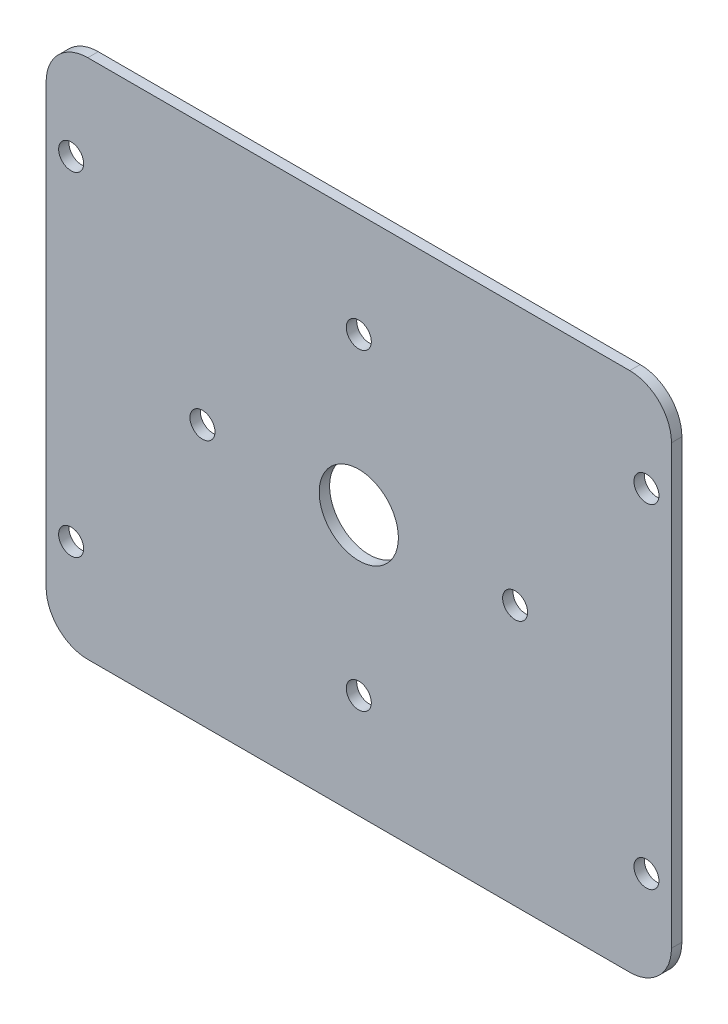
from build123d import *

# Parameters (mm, degrees)
ESQUISSE1_W             = 300
ESQUISSE1_H             = 250
EXTRUSION1_DEPTH        = 5
ESQUISSE2_R             = 19
ENL_V_MAT_EXTRU_1_DEPTH = 391.544491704
CONG_1_R                = 20
ESQUISSE3_R             = 6
ENL_V_MAT_EXTRU_2_DEPTH = 391.544491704
ESQUISSE4_R             = 6
ENL_V_MAT_EXTRU_3_DEPTH = 391.544491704


with BuildPart() as part:
    # Esquisse1 → Extrusion1 (new body)
    with BuildSketch(Plane.XY):
        with Locations((150, 125)):
            Rectangle(ESQUISSE1_W, ESQUISSE1_H)
    extrude(amount=EXTRUSION1_DEPTH)

    # Esquisse2 → Enl_v. mat.-Extru.1 (cut, through all)
    with BuildSketch(Plane.XY.offset(5)):
        with Locations((150, 125)):
            Circle(ESQUISSE2_R)
    extrude(amount=-ENL_V_MAT_EXTRU_1_DEPTH, mode=Mode.SUBTRACT)

    # Cong_1
    cong_1_edges = [part.edges().sort_by_distance(p)[0] for p in [
        (0, 250, 2.5),
        (300, 250, 2.5),
        (300, 0, 2.5),
        (0, 0, 2.5),
    ]]
    fillet(cong_1_edges, radius=CONG_1_R)

    # Esquisse3 → Enl_v. mat.-Extru.2 (cut, through all)
    with BuildSketch(Plane.XY.offset(5)):
        with Locations((12, 205)):
            Circle(ESQUISSE3_R)
        with Locations(Location((12, 45, 0), (0, 0, 180))):
            Circle(ESQUISSE3_R)
        with Locations((288, 45)):
            Circle(ESQUISSE3_R)
        with Locations(Location((288, 205, 0), (0, 0, 180))):
            Circle(ESQUISSE3_R)
    extrude(amount=-ENL_V_MAT_EXTRU_2_DEPTH, mode=Mode.SUBTRACT)

    # Esquisse4 → Enl_v. mat.-Extru.3 (cut, through all)
    with BuildSketch(Plane(origin=(0, 0, 0), x_dir=(-1, 0, 0), z_dir=(0, 0, -1))):
        with Locations((-225, 125)):
            Circle(ESQUISSE4_R)
        with Locations((-150, 50)):
            Circle(ESQUISSE4_R)
        with Locations((-75, 125)):
            Circle(ESQUISSE4_R)
        with Locations((-150, 200)):
            Circle(ESQUISSE4_R)
    extrude(amount=-ENL_V_MAT_EXTRU_3_DEPTH, mode=Mode.SUBTRACT)


solid = part.part
